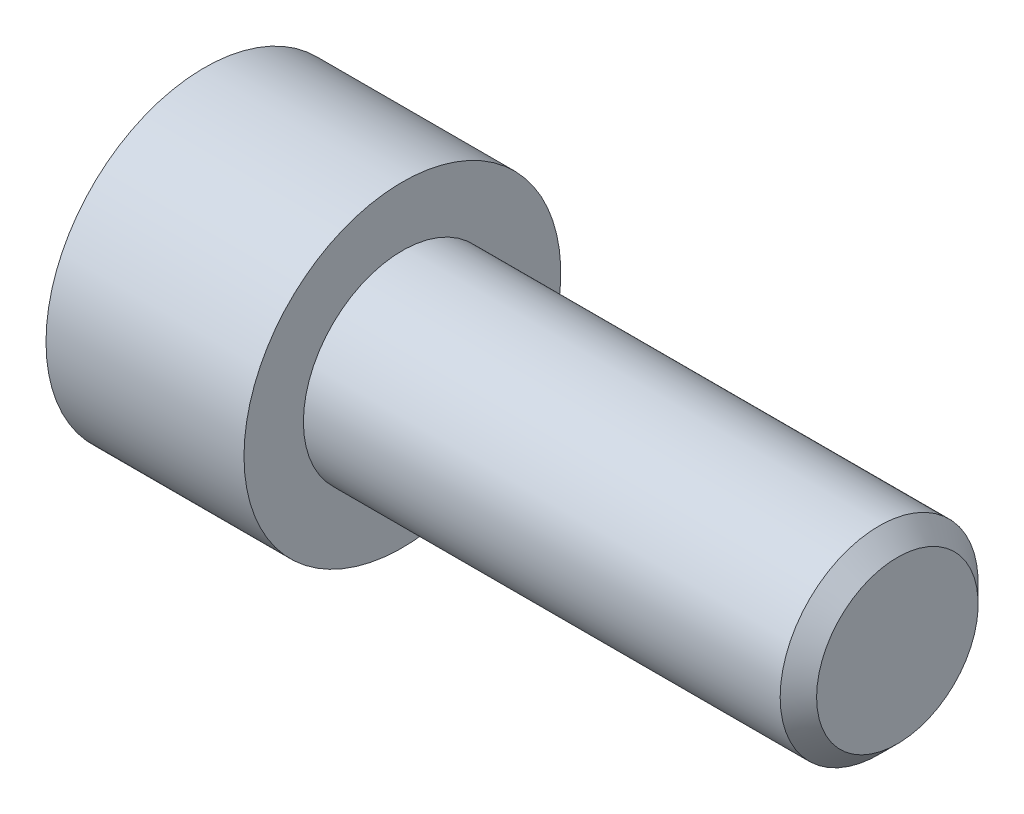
ISO-10303-21;
HEADER;
FILE_DESCRIPTION(('STEP AP214'),'2;1');
FILE_NAME('part.step','',(''),(''),'','','');
FILE_SCHEMA(('AUTOMOTIVE_DESIGN { 1 0 10303 214 1 1 1 1 }'));
ENDSEC;
DATA;
#1=APPLICATION_CONTEXT('core data for automotive mechanical design processes');
#2=APPLICATION_PROTOCOL_DEFINITION('international standard','automotive_design',2000,#1);
#3=PRODUCT_CONTEXT('',#1,'mechanical');
#4=PRODUCT('Part','Part','',(#3));
#5=PRODUCT_RELATED_PRODUCT_CATEGORY('part','',(#4));
#6=PRODUCT_DEFINITION_FORMATION('','',#4);
#7=PRODUCT_DEFINITION_CONTEXT('part definition',#1,'design');
#8=PRODUCT_DEFINITION('design','',#6,#7);
#9=PRODUCT_DEFINITION_SHAPE('','',#8);
#10=(LENGTH_UNIT() NAMED_UNIT(*) SI_UNIT(.MILLI.,.METRE.));
#11=(NAMED_UNIT(*) PLANE_ANGLE_UNIT() SI_UNIT($,.RADIAN.));
#12=(NAMED_UNIT(*) SI_UNIT($,.STERADIAN.) SOLID_ANGLE_UNIT());
#13=UNCERTAINTY_MEASURE_WITH_UNIT(LENGTH_MEASURE(1.E-05),#10,'distance_accuracy_value','');
#14=(GEOMETRIC_REPRESENTATION_CONTEXT(3) GLOBAL_UNCERTAINTY_ASSIGNED_CONTEXT((#13)) GLOBAL_UNIT_ASSIGNED_CONTEXT((#10,
#11,#12)) REPRESENTATION_CONTEXT('',''));
#15=CARTESIAN_POINT('',(0.,0.,0.));
#16=DIRECTION('',(0.,0.,1.));
#17=DIRECTION('',(1.,0.,0.));
#18=AXIS2_PLACEMENT_3D('',#15,#16,#17);
#19=CARTESIAN_POINT('',(-5.,2.3094010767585,4.));
#20=DIRECTION('',(1.,0.,0.));
#21=DIRECTION('',(0.,0.,-1.));
#22=AXIS2_PLACEMENT_3D('',#19,#20,#21);
#23=PLANE('',#22);
#24=DIRECTION('',(0.,-0.5,0.866025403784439));
#25=VECTOR('',#24,1.);
#26=CARTESIAN_POINT('',(-5.,4.61880215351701,0.));
#27=LINE('',#26,#25);
#28=CARTESIAN_POINT('',(-5.,4.61880215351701,0.));
#29=VERTEX_POINT('',#28);
#30=CARTESIAN_POINT('',(-5.,2.3094010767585,4.));
#31=VERTEX_POINT('',#30);
#32=EDGE_CURVE('E182',#29,#31,#27,.T.);
#33=ORIENTED_EDGE('',*,*,#32,.F.);
#34=DIRECTION('',(0.,0.5,0.866025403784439));
#35=VECTOR('',#34,1.);
#36=CARTESIAN_POINT('',(-5.,2.3094010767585,-4.));
#37=LINE('',#36,#35);
#38=CARTESIAN_POINT('',(-5.,2.3094010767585,-4.));
#39=VERTEX_POINT('',#38);
#40=EDGE_CURVE('E54',#39,#29,#37,.T.);
#41=ORIENTED_EDGE('',*,*,#40,.F.);
#42=DIRECTION('',(0.,1.,0.));
#43=VECTOR('',#42,1.);
#44=CARTESIAN_POINT('',(-5.,-2.3094010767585,-4.));
#45=LINE('',#44,#43);
#46=CARTESIAN_POINT('',(-5.,-2.3094010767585,-4.));
#47=VERTEX_POINT('',#46);
#48=EDGE_CURVE('E174',#47,#39,#45,.T.);
#49=ORIENTED_EDGE('',*,*,#48,.F.);
#50=DIRECTION('',(0.,0.5,-0.866025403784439));
#51=VECTOR('',#50,1.);
#52=CARTESIAN_POINT('',(-5.,-4.61880215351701,0.));
#53=LINE('',#52,#51);
#54=CARTESIAN_POINT('',(-5.,-4.61880215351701,0.));
#55=VERTEX_POINT('',#54);
#56=EDGE_CURVE('E176',#55,#47,#53,.T.);
#57=ORIENTED_EDGE('',*,*,#56,.F.);
#58=DIRECTION('',(0.,-0.5,-0.866025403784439));
#59=VECTOR('',#58,1.);
#60=CARTESIAN_POINT('',(-5.,-2.3094010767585,4.));
#61=LINE('',#60,#59);
#62=CARTESIAN_POINT('',(-5.,-2.3094010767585,4.));
#63=VERTEX_POINT('',#62);
#64=EDGE_CURVE('E178',#63,#55,#61,.T.);
#65=ORIENTED_EDGE('',*,*,#64,.F.);
#66=DIRECTION('',(0.,-1.,0.));
#67=VECTOR('',#66,1.);
#68=CARTESIAN_POINT('',(-5.,2.3094010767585,4.));
#69=LINE('',#68,#67);
#70=EDGE_CURVE('E180',#31,#63,#69,.T.);
#71=ORIENTED_EDGE('',*,*,#70,.F.);
#72=EDGE_LOOP('',(#33,#41,#49,#57,#65,#71));
#73=FACE_BOUND('',#72,.T.);
#74=CARTESIAN_POINT('',(-5.,0.,0.));
#75=DIRECTION('',(-1.,0.,0.));
#76=DIRECTION('',(0.,0.,1.));
#77=AXIS2_PLACEMENT_3D('',#74,#75,#76);
#78=CIRCLE('',#77,3.99);
#79=CARTESIAN_POINT('',(-5.,0.,3.99));
#80=VERTEX_POINT('',#79);
#81=EDGE_CURVE('E201',#80,#80,#78,.T.);
#82=ORIENTED_EDGE('',*,*,#81,.F.);
#83=EDGE_LOOP('',(#82));
#84=FACE_BOUND('',#83,.T.);
#85=ADVANCED_FACE('F32',(#73,#84),#23,.F.);
#86=CARTESIAN_POINT('',(-10.,0.,0.));
#87=DIRECTION('',(1.,0.,0.));
#88=DIRECTION('',(0.,0.,-1.));
#89=AXIS2_PLACEMENT_3D('',#86,#87,#88);
#90=PLANE('',#89);
#91=CARTESIAN_POINT('',(-10.,0.,0.));
#92=DIRECTION('',(-1.,0.,0.));
#93=DIRECTION('',(0.,0.,1.));
#94=AXIS2_PLACEMENT_3D('',#91,#92,#93);
#95=CIRCLE('',#94,8.);
#96=CARTESIAN_POINT('',(-10.,0.,8.));
#97=VERTEX_POINT('',#96);
#98=EDGE_CURVE('E11',#97,#97,#95,.T.);
#99=ORIENTED_EDGE('',*,*,#98,.T.);
#100=EDGE_LOOP('',(#99));
#101=FACE_BOUND('',#100,.T.);
#102=DIRECTION('',(0.,-0.5,0.866025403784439));
#103=VECTOR('',#102,1.);
#104=CARTESIAN_POINT('',(-10.,4.61880215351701,0.));
#105=LINE('',#104,#103);
#106=CARTESIAN_POINT('',(-10.,4.61880215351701,0.));
#107=VERTEX_POINT('',#106);
#108=CARTESIAN_POINT('',(-10.,2.3094010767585,4.));
#109=VERTEX_POINT('',#108);
#110=EDGE_CURVE('E47',#107,#109,#105,.T.);
#111=ORIENTED_EDGE('',*,*,#110,.T.);
#112=DIRECTION('',(0.,-1.,0.));
#113=VECTOR('',#112,1.);
#114=CARTESIAN_POINT('',(-10.,2.3094010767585,4.));
#115=LINE('',#114,#113);
#116=CARTESIAN_POINT('',(-10.,-2.3094010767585,4.));
#117=VERTEX_POINT('',#116);
#118=EDGE_CURVE('E197',#109,#117,#115,.T.);
#119=ORIENTED_EDGE('',*,*,#118,.T.);
#120=DIRECTION('',(0.,-0.5,-0.866025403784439));
#121=VECTOR('',#120,1.);
#122=CARTESIAN_POINT('',(-10.,-2.3094010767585,4.));
#123=LINE('',#122,#121);
#124=CARTESIAN_POINT('',(-10.,-4.61880215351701,0.));
#125=VERTEX_POINT('',#124);
#126=EDGE_CURVE('E194',#117,#125,#123,.T.);
#127=ORIENTED_EDGE('',*,*,#126,.T.);
#128=DIRECTION('',(0.,0.5,-0.866025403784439));
#129=VECTOR('',#128,1.);
#130=CARTESIAN_POINT('',(-10.,-4.61880215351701,0.));
#131=LINE('',#130,#129);
#132=CARTESIAN_POINT('',(-10.,-2.3094010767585,-4.));
#133=VERTEX_POINT('',#132);
#134=EDGE_CURVE('E191',#125,#133,#131,.T.);
#135=ORIENTED_EDGE('',*,*,#134,.T.);
#136=DIRECTION('',(0.,1.,0.));
#137=VECTOR('',#136,1.);
#138=CARTESIAN_POINT('',(-10.,-2.3094010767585,-4.));
#139=LINE('',#138,#137);
#140=CARTESIAN_POINT('',(-10.,2.3094010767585,-4.));
#141=VERTEX_POINT('',#140);
#142=EDGE_CURVE('E188',#133,#141,#139,.T.);
#143=ORIENTED_EDGE('',*,*,#142,.T.);
#144=DIRECTION('',(0.,0.5,0.866025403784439));
#145=VECTOR('',#144,1.);
#146=CARTESIAN_POINT('',(-10.,2.3094010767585,-4.));
#147=LINE('',#146,#145);
#148=EDGE_CURVE('E185',#141,#107,#147,.T.);
#149=ORIENTED_EDGE('',*,*,#148,.T.);
#150=EDGE_LOOP('',(#111,#119,#127,#135,#143,#149));
#151=FACE_BOUND('',#150,.T.);
#152=ADVANCED_FACE('F34',(#101,#151),#90,.F.);
#153=CARTESIAN_POINT('',(25.,0.,0.));
#154=DIRECTION('',(-1.,0.,0.));
#155=DIRECTION('',(0.,0.,1.));
#156=AXIS2_PLACEMENT_3D('',#153,#154,#155);
#157=CYLINDRICAL_SURFACE('',#156,8.);
#158=ORIENTED_EDGE('',*,*,#98,.F.);
#159=EDGE_LOOP('',(#158));
#160=FACE_BOUND('',#159,.T.);
#161=CARTESIAN_POINT('',(0.,0.,0.));
#162=DIRECTION('',(-1.,0.,0.));
#163=DIRECTION('',(0.,0.,1.));
#164=AXIS2_PLACEMENT_3D('',#161,#162,#163);
#165=CIRCLE('',#164,8.);
#166=CARTESIAN_POINT('',(0.,0.,8.));
#167=VERTEX_POINT('',#166);
#168=EDGE_CURVE('E40',#167,#167,#165,.T.);
#169=ORIENTED_EDGE('',*,*,#168,.T.);
#170=EDGE_LOOP('',(#169));
#171=FACE_BOUND('',#170,.T.);
#172=ADVANCED_FACE('F105',(#160,#171),#157,.T.);
#173=CARTESIAN_POINT('',(0.,8.,0.));
#174=DIRECTION('',(-1.,0.,0.));
#175=DIRECTION('',(0.,0.,1.));
#176=AXIS2_PLACEMENT_3D('',#173,#174,#175);
#177=PLANE('',#176);
#178=ORIENTED_EDGE('',*,*,#168,.F.);
#179=EDGE_LOOP('',(#178));
#180=FACE_BOUND('',#179,.T.);
#181=CARTESIAN_POINT('',(0.,0.,0.));
#182=DIRECTION('',(-1.,0.,0.));
#183=DIRECTION('',(0.,0.,1.));
#184=AXIS2_PLACEMENT_3D('',#181,#182,#183);
#185=CIRCLE('',#184,5.);
#186=CARTESIAN_POINT('',(0.,0.,5.));
#187=VERTEX_POINT('',#186);
#188=EDGE_CURVE('E151',#187,#187,#185,.T.);
#189=ORIENTED_EDGE('',*,*,#188,.T.);
#190=EDGE_LOOP('',(#189));
#191=FACE_BOUND('',#190,.T.);
#192=ADVANCED_FACE('F139',(#180,#191),#177,.F.);
#193=CARTESIAN_POINT('',(25.,0.,0.));
#194=DIRECTION('',(-1.,0.,0.));
#195=DIRECTION('',(0.,0.,1.));
#196=AXIS2_PLACEMENT_3D('',#193,#194,#195);
#197=CYLINDRICAL_SURFACE('',#196,5.);
#198=ORIENTED_EDGE('',*,*,#188,.F.);
#199=EDGE_LOOP('',(#198));
#200=FACE_BOUND('',#199,.T.);
#201=CARTESIAN_POINT('',(24.08,0.,0.));
#202=DIRECTION('',(-1.,0.,0.));
#203=DIRECTION('',(0.,0.,1.));
#204=AXIS2_PLACEMENT_3D('',#201,#202,#203);
#205=CIRCLE('',#204,5.);
#206=CARTESIAN_POINT('',(24.08,0.,5.));
#207=VERTEX_POINT('',#206);
#208=EDGE_CURVE('E153',#207,#207,#205,.T.);
#209=ORIENTED_EDGE('',*,*,#208,.T.);
#210=EDGE_LOOP('',(#209));
#211=FACE_BOUND('',#210,.T.);
#212=ADVANCED_FACE('F135',(#200,#211),#197,.T.);
#213=CARTESIAN_POINT('',(25.,0.,0.));
#214=DIRECTION('',(-1.,0.,0.));
#215=DIRECTION('',(0.,0.,1.));
#216=AXIS2_PLACEMENT_3D('',#213,#214,#215);
#217=CONICAL_SURFACE('',#216,4.08,0.785398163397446);
#218=ORIENTED_EDGE('',*,*,#208,.F.);
#219=EDGE_LOOP('',(#218));
#220=FACE_BOUND('',#219,.T.);
#221=CARTESIAN_POINT('',(25.,0.,0.));
#222=DIRECTION('',(-1.,0.,0.));
#223=DIRECTION('',(0.,0.,1.));
#224=AXIS2_PLACEMENT_3D('',#221,#222,#223);
#225=CIRCLE('',#224,4.08);
#226=CARTESIAN_POINT('',(25.,0.,4.08));
#227=VERTEX_POINT('',#226);
#228=EDGE_CURVE('E158',#227,#227,#225,.T.);
#229=ORIENTED_EDGE('',*,*,#228,.T.);
#230=EDGE_LOOP('',(#229));
#231=FACE_BOUND('',#230,.T.);
#232=ADVANCED_FACE('F131',(#220,#231),#217,.T.);
#233=CARTESIAN_POINT('',(25.,4.08,0.));
#234=DIRECTION('',(-1.,0.,0.));
#235=DIRECTION('',(0.,0.,1.));
#236=AXIS2_PLACEMENT_3D('',#233,#234,#235);
#237=PLANE('',#236);
#238=ORIENTED_EDGE('',*,*,#228,.F.);
#239=EDGE_LOOP('',(#238));
#240=FACE_BOUND('',#239,.T.);
#241=ADVANCED_FACE('F128',(#240),#237,.F.);
#242=CARTESIAN_POINT('',(-5.,4.61880215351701,0.));
#243=DIRECTION('',(0.,-0.866025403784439,-0.5));
#244=DIRECTION('',(0.,0.5,-0.866025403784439));
#245=AXIS2_PLACEMENT_3D('',#242,#243,#244);
#246=PLANE('',#245);
#247=ORIENTED_EDGE('',*,*,#110,.F.);
#248=DIRECTION('',(-1.,0.,0.));
#249=VECTOR('',#248,1.);
#250=CARTESIAN_POINT('',(-5.,4.61880215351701,0.));
#251=LINE('',#250,#249);
#252=EDGE_CURVE('E171',#29,#107,#251,.T.);
#253=ORIENTED_EDGE('',*,*,#252,.F.);
#254=ORIENTED_EDGE('',*,*,#32,.T.);
#255=DIRECTION('',(-1.,0.,0.));
#256=VECTOR('',#255,1.);
#257=CARTESIAN_POINT('',(-5.,2.3094010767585,4.));
#258=LINE('',#257,#256);
#259=EDGE_CURVE('E161',#31,#109,#258,.T.);
#260=ORIENTED_EDGE('',*,*,#259,.T.);
#261=EDGE_LOOP('',(#247,#253,#254,#260));
#262=FACE_BOUND('',#261,.T.);
#263=ADVANCED_FACE('F124',(#262),#246,.T.);
#264=CARTESIAN_POINT('',(-5.,2.3094010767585,4.));
#265=DIRECTION('',(0.,0.,-1.));
#266=DIRECTION('',(-1.,0.,0.));
#267=AXIS2_PLACEMENT_3D('',#264,#265,#266);
#268=PLANE('',#267);
#269=ORIENTED_EDGE('',*,*,#118,.F.);
#270=ORIENTED_EDGE('',*,*,#259,.F.);
#271=ORIENTED_EDGE('',*,*,#70,.T.);
#272=DIRECTION('',(-1.,0.,0.));
#273=VECTOR('',#272,1.);
#274=CARTESIAN_POINT('',(-5.,-2.3094010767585,4.));
#275=LINE('',#274,#273);
#276=EDGE_CURVE('E163',#63,#117,#275,.T.);
#277=ORIENTED_EDGE('',*,*,#276,.T.);
#278=EDGE_LOOP('',(#269,#270,#271,#277));
#279=FACE_BOUND('',#278,.T.);
#280=ADVANCED_FACE('F120',(#279),#268,.T.);
#281=CARTESIAN_POINT('',(-5.,-2.3094010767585,4.));
#282=DIRECTION('',(0.,0.866025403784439,-0.5));
#283=DIRECTION('',(0.,0.5,0.866025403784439));
#284=AXIS2_PLACEMENT_3D('',#281,#282,#283);
#285=PLANE('',#284);
#286=ORIENTED_EDGE('',*,*,#126,.F.);
#287=ORIENTED_EDGE('',*,*,#276,.F.);
#288=ORIENTED_EDGE('',*,*,#64,.T.);
#289=DIRECTION('',(-1.,0.,0.));
#290=VECTOR('',#289,1.);
#291=CARTESIAN_POINT('',(-5.,-4.61880215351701,0.));
#292=LINE('',#291,#290);
#293=EDGE_CURVE('E165',#55,#125,#292,.T.);
#294=ORIENTED_EDGE('',*,*,#293,.T.);
#295=EDGE_LOOP('',(#286,#287,#288,#294));
#296=FACE_BOUND('',#295,.T.);
#297=ADVANCED_FACE('F116',(#296),#285,.T.);
#298=CARTESIAN_POINT('',(-5.,-4.61880215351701,0.));
#299=DIRECTION('',(0.,0.866025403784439,0.5));
#300=DIRECTION('',(0.,-0.5,0.866025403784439));
#301=AXIS2_PLACEMENT_3D('',#298,#299,#300);
#302=PLANE('',#301);
#303=ORIENTED_EDGE('',*,*,#134,.F.);
#304=ORIENTED_EDGE('',*,*,#293,.F.);
#305=ORIENTED_EDGE('',*,*,#56,.T.);
#306=DIRECTION('',(-1.,0.,0.));
#307=VECTOR('',#306,1.);
#308=CARTESIAN_POINT('',(-5.,-2.3094010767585,-4.));
#309=LINE('',#308,#307);
#310=EDGE_CURVE('E167',#47,#133,#309,.T.);
#311=ORIENTED_EDGE('',*,*,#310,.T.);
#312=EDGE_LOOP('',(#303,#304,#305,#311));
#313=FACE_BOUND('',#312,.T.);
#314=ADVANCED_FACE('F112',(#313),#302,.T.);
#315=CARTESIAN_POINT('',(-5.,-2.3094010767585,-4.));
#316=DIRECTION('',(0.,0.,1.));
#317=DIRECTION('',(1.,0.,0.));
#318=AXIS2_PLACEMENT_3D('',#315,#316,#317);
#319=PLANE('',#318);
#320=ORIENTED_EDGE('',*,*,#142,.F.);
#321=ORIENTED_EDGE('',*,*,#310,.F.);
#322=ORIENTED_EDGE('',*,*,#48,.T.);
#323=DIRECTION('',(-1.,0.,0.));
#324=VECTOR('',#323,1.);
#325=CARTESIAN_POINT('',(-5.,2.3094010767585,-4.));
#326=LINE('',#325,#324);
#327=EDGE_CURVE('E169',#39,#141,#326,.T.);
#328=ORIENTED_EDGE('',*,*,#327,.T.);
#329=EDGE_LOOP('',(#320,#321,#322,#328));
#330=FACE_BOUND('',#329,.T.);
#331=ADVANCED_FACE('F96',(#330),#319,.T.);
#332=CARTESIAN_POINT('',(-5.,2.3094010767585,-4.));
#333=DIRECTION('',(0.,-0.866025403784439,0.5));
#334=DIRECTION('',(0.,-0.5,-0.866025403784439));
#335=AXIS2_PLACEMENT_3D('',#332,#333,#334);
#336=PLANE('',#335);
#337=ORIENTED_EDGE('',*,*,#148,.F.);
#338=ORIENTED_EDGE('',*,*,#327,.F.);
#339=ORIENTED_EDGE('',*,*,#40,.T.);
#340=ORIENTED_EDGE('',*,*,#252,.T.);
#341=EDGE_LOOP('',(#337,#338,#339,#340));
#342=FACE_BOUND('',#341,.T.);
#343=ADVANCED_FACE('F90',(#342),#336,.T.);
#344=CARTESIAN_POINT('',(-2.69637242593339,0.,0.));
#345=DIRECTION('',(-1.,0.,0.));
#346=DIRECTION('',(0.,0.,1.));
#347=AXIS2_PLACEMENT_3D('',#344,#345,#346);
#348=CONICAL_SURFACE('',#347,0.,1.0471975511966);
#349=ORIENTED_EDGE('',*,*,#81,.T.);
#350=EDGE_LOOP('',(#349));
#351=FACE_BOUND('',#350,.T.);
#352=CARTESIAN_POINT('',(-2.69637242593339,0.,0.));
#353=VERTEX_POINT('',#352);
#354=VERTEX_LOOP('',#353);
#355=FACE_BOUND('',#354,.T.);
#356=ADVANCED_FACE('F88',(#351,#355),#348,.F.);
#357=CLOSED_SHELL('',(#85,#152,#172,#192,#212,#232,#241,#263,#280,#297,#314,#331,#343,#356));
#358=MANIFOLD_SOLID_BREP('B2',#357);
#359=ADVANCED_BREP_SHAPE_REPRESENTATION('',(#18,#358),#14);
#360=SHAPE_DEFINITION_REPRESENTATION(#9,#359);
ENDSEC;
END-ISO-10303-21;
